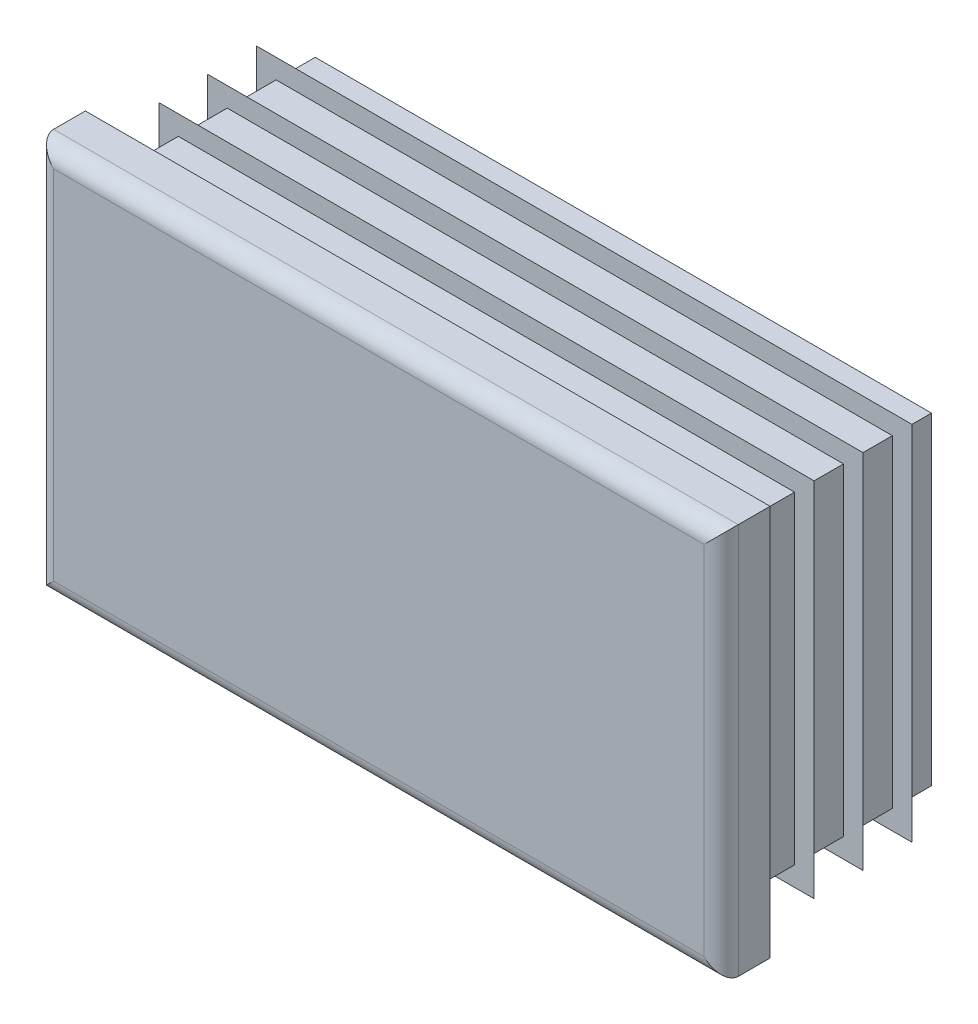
ISO-10303-21;
HEADER;
FILE_DESCRIPTION(('STEP AP214'),'2;1');
FILE_NAME('part.step','',(''),(''),'','','');
FILE_SCHEMA(('AUTOMOTIVE_DESIGN { 1 0 10303 214 1 1 1 1 }'));
ENDSEC;
DATA;
#1=APPLICATION_CONTEXT('core data for automotive mechanical design processes');
#2=APPLICATION_PROTOCOL_DEFINITION('international standard','automotive_design',2000,#1);
#3=PRODUCT_CONTEXT('',#1,'mechanical');
#4=PRODUCT('Part','Part','',(#3));
#5=PRODUCT_RELATED_PRODUCT_CATEGORY('part','',(#4));
#6=PRODUCT_DEFINITION_FORMATION('','',#4);
#7=PRODUCT_DEFINITION_CONTEXT('part definition',#1,'design');
#8=PRODUCT_DEFINITION('design','',#6,#7);
#9=PRODUCT_DEFINITION_SHAPE('','',#8);
#10=(LENGTH_UNIT() NAMED_UNIT(*) SI_UNIT(.MILLI.,.METRE.));
#11=(NAMED_UNIT(*) PLANE_ANGLE_UNIT() SI_UNIT($,.RADIAN.));
#12=(NAMED_UNIT(*) SI_UNIT($,.STERADIAN.) SOLID_ANGLE_UNIT());
#13=UNCERTAINTY_MEASURE_WITH_UNIT(LENGTH_MEASURE(1.E-05),#10,'distance_accuracy_value','');
#14=(GEOMETRIC_REPRESENTATION_CONTEXT(3) GLOBAL_UNCERTAINTY_ASSIGNED_CONTEXT((#13)) GLOBAL_UNIT_ASSIGNED_CONTEXT((#10,
#11,#12)) REPRESENTATION_CONTEXT('',''));
#15=CARTESIAN_POINT('',(0.,0.,0.));
#16=DIRECTION('',(0.,0.,1.));
#17=DIRECTION('',(1.,0.,0.));
#18=AXIS2_PLACEMENT_3D('',#15,#16,#17);
#19=CARTESIAN_POINT('',(33.25,-20.,5.));
#20=DIRECTION('',(0.,0.,-1.));
#21=DIRECTION('',(0.,1.,0.));
#22=AXIS2_PLACEMENT_3D('',#19,#20,#21);
#23=PLANE('',#22);
#24=DIRECTION('',(0.,1.,0.));
#25=VECTOR('',#24,1.);
#26=CARTESIAN_POINT('',(-33.25,-20.,5.));
#27=LINE('',#26,#25);
#28=CARTESIAN_POINT('',(-33.25,-18.25,5.));
#29=VERTEX_POINT('',#28);
#30=CARTESIAN_POINT('',(-33.25,18.25,5.));
#31=VERTEX_POINT('',#30);
#32=EDGE_CURVE('E310',#29,#31,#27,.T.);
#33=ORIENTED_EDGE('',*,*,#32,.F.);
#34=DIRECTION('',(-1.,0.,0.));
#35=VECTOR('',#34,1.);
#36=CARTESIAN_POINT('',(35.,-18.25,5.));
#37=LINE('',#36,#35);
#38=CARTESIAN_POINT('',(33.25,-18.25,5.));
#39=VERTEX_POINT('',#38);
#40=EDGE_CURVE('E482',#39,#29,#37,.T.);
#41=ORIENTED_EDGE('',*,*,#40,.F.);
#42=DIRECTION('',(0.,1.,0.));
#43=VECTOR('',#42,1.);
#44=CARTESIAN_POINT('',(33.25,-20.,5.));
#45=LINE('',#44,#43);
#46=CARTESIAN_POINT('',(33.25,18.25,5.));
#47=VERTEX_POINT('',#46);
#48=EDGE_CURVE('E305',#39,#47,#45,.T.);
#49=ORIENTED_EDGE('',*,*,#48,.T.);
#50=DIRECTION('',(-1.,0.,0.));
#51=VECTOR('',#50,1.);
#52=CARTESIAN_POINT('',(35.,18.25,5.));
#53=LINE('',#52,#51);
#54=EDGE_CURVE('E630',#47,#31,#53,.T.);
#55=ORIENTED_EDGE('',*,*,#54,.T.);
#56=EDGE_LOOP('',(#33,#41,#49,#55));
#57=FACE_BOUND('',#56,.T.);
#58=ADVANCED_FACE('F14',(#57),#23,.F.);
#59=CARTESIAN_POINT('',(-33.25,-20.,3.25));
#60=DIRECTION('',(0.,1.,0.));
#61=DIRECTION('',(-1.,0.,0.));
#62=AXIS2_PLACEMENT_3D('',#59,#60,#61);
#63=CYLINDRICAL_SURFACE('',#62,1.75);
#64=DIRECTION('',(0.,1.,0.));
#65=VECTOR('',#64,1.);
#66=CARTESIAN_POINT('',(-35.,-20.,3.25));
#67=LINE('',#66,#65);
#68=CARTESIAN_POINT('',(-35.,-20.,3.25));
#69=VERTEX_POINT('',#68);
#70=CARTESIAN_POINT('',(-35.,20.,3.25));
#71=VERTEX_POINT('',#70);
#72=EDGE_CURVE('E402',#69,#71,#67,.T.);
#73=ORIENTED_EDGE('',*,*,#72,.F.);
#74=CARTESIAN_POINT('',(-33.25,-18.25,3.25));
#75=DIRECTION('',(-0.707106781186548,0.707106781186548,0.));
#76=DIRECTION('',(0.707106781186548,0.707106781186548,0.));
#77=AXIS2_PLACEMENT_3D('',#74,#75,#76);
#78=ELLIPSE('',#77,2.47487373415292,1.75);
#79=EDGE_CURVE('E59',#69,#29,#78,.T.);
#80=ORIENTED_EDGE('',*,*,#79,.T.);
#81=ORIENTED_EDGE('',*,*,#32,.T.);
#82=CARTESIAN_POINT('',(-33.25,18.25,3.25));
#83=DIRECTION('',(0.707106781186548,0.707106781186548,0.));
#84=DIRECTION('',(-0.707106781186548,0.707106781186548,0.));
#85=AXIS2_PLACEMENT_3D('',#82,#83,#84);
#86=ELLIPSE('',#85,2.47487373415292,1.75);
#87=EDGE_CURVE('E306',#31,#71,#86,.F.);
#88=ORIENTED_EDGE('',*,*,#87,.T.);
#89=EDGE_LOOP('',(#73,#80,#81,#88));
#90=FACE_BOUND('',#89,.T.);
#91=ADVANCED_FACE('F16',(#90),#63,.T.);
#92=CARTESIAN_POINT('',(-35.,-20.,3.25));
#93=DIRECTION('',(1.,0.,0.));
#94=DIRECTION('',(0.,1.,0.));
#95=AXIS2_PLACEMENT_3D('',#92,#93,#94);
#96=PLANE('',#95);
#97=DIRECTION('',(0.,0.,-1.));
#98=VECTOR('',#97,1.);
#99=CARTESIAN_POINT('',(-35.,20.,3.25));
#100=LINE('',#99,#98);
#101=CARTESIAN_POINT('',(-35.,20.,0.));
#102=VERTEX_POINT('',#101);
#103=EDGE_CURVE('E615',#71,#102,#100,.T.);
#104=ORIENTED_EDGE('',*,*,#103,.T.);
#105=DIRECTION('',(0.,1.,0.));
#106=VECTOR('',#105,1.);
#107=CARTESIAN_POINT('',(-35.,-20.,0.));
#108=LINE('',#107,#106);
#109=CARTESIAN_POINT('',(-35.,-20.,0.));
#110=VERTEX_POINT('',#109);
#111=EDGE_CURVE('E400',#110,#102,#108,.T.);
#112=ORIENTED_EDGE('',*,*,#111,.F.);
#113=DIRECTION('',(0.,0.,-1.));
#114=VECTOR('',#113,1.);
#115=CARTESIAN_POINT('',(-35.,-20.,3.25));
#116=LINE('',#115,#114);
#117=EDGE_CURVE('E616',#69,#110,#116,.T.);
#118=ORIENTED_EDGE('',*,*,#117,.F.);
#119=ORIENTED_EDGE('',*,*,#72,.T.);
#120=EDGE_LOOP('',(#104,#112,#118,#119));
#121=FACE_BOUND('',#120,.T.);
#122=ADVANCED_FACE('F697',(#121),#96,.F.);
#123=CARTESIAN_POINT('',(-31.5,-20.,0.));
#124=DIRECTION('',(1.,0.,0.));
#125=DIRECTION('',(0.,1.,0.));
#126=AXIS2_PLACEMENT_3D('',#123,#124,#125);
#127=PLANE('',#126);
#128=DIRECTION('',(0.,1.,0.));
#129=VECTOR('',#128,1.);
#130=CARTESIAN_POINT('',(-31.5,-20.,0.));
#131=LINE('',#130,#129);
#132=CARTESIAN_POINT('',(-31.5,-16.5,0.));
#133=VERTEX_POINT('',#132);
#134=CARTESIAN_POINT('',(-31.5,16.5,0.));
#135=VERTEX_POINT('',#134);
#136=EDGE_CURVE('E397',#133,#135,#131,.T.);
#137=ORIENTED_EDGE('',*,*,#136,.T.);
#138=DIRECTION('',(0.,0.,-1.));
#139=VECTOR('',#138,1.);
#140=CARTESIAN_POINT('',(-31.5,16.5,0.));
#141=LINE('',#140,#139);
#142=CARTESIAN_POINT('',(-31.5,16.5,-1.));
#143=VERTEX_POINT('',#142);
#144=EDGE_CURVE('E495',#135,#143,#141,.T.);
#145=ORIENTED_EDGE('',*,*,#144,.T.);
#146=DIRECTION('',(0.,1.,0.));
#147=VECTOR('',#146,1.);
#148=CARTESIAN_POINT('',(-31.5,-20.,-1.));
#149=LINE('',#148,#147);
#150=CARTESIAN_POINT('',(-31.5,-16.5,-1.));
#151=VERTEX_POINT('',#150);
#152=EDGE_CURVE('E394',#151,#143,#149,.T.);
#153=ORIENTED_EDGE('',*,*,#152,.F.);
#154=DIRECTION('',(0.,0.,1.));
#155=VECTOR('',#154,1.);
#156=CARTESIAN_POINT('',(-31.5,-16.5,0.));
#157=LINE('',#156,#155);
#158=EDGE_CURVE('E489',#151,#133,#157,.T.);
#159=ORIENTED_EDGE('',*,*,#158,.T.);
#160=EDGE_LOOP('',(#137,#145,#153,#159));
#161=FACE_BOUND('',#160,.T.);
#162=ADVANCED_FACE('F787',(#161),#127,.F.);
#163=CARTESIAN_POINT('',(-33.5,-20.,-1.));
#164=DIRECTION('',(0.342020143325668,0.,0.939692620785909));
#165=DIRECTION('',(-0.939692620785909,0.,0.342020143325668));
#166=AXIS2_PLACEMENT_3D('',#163,#164,#165);
#167=PLANE('',#166);
#168=DIRECTION('',(0.,1.,0.));
#169=VECTOR('',#168,1.);
#170=CARTESIAN_POINT('',(-33.5,-20.,-1.));
#171=LINE('',#170,#169);
#172=CARTESIAN_POINT('',(-33.5,-18.5,-1.));
#173=VERTEX_POINT('',#172);
#174=CARTESIAN_POINT('',(-33.5,18.5,-1.));
#175=VERTEX_POINT('',#174);
#176=EDGE_CURVE('E392',#173,#175,#171,.T.);
#177=ORIENTED_EDGE('',*,*,#176,.T.);
#178=DIRECTION('',(0.844349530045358,-0.43889572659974,-0.307318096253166));
#179=VECTOR('',#178,1.);
#180=CARTESIAN_POINT('',(-19.2326160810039,11.0837658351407,-6.19290306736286));
#181=LINE('',#180,#179);
#182=CARTESIAN_POINT('',(-31.5,17.4603932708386,-1.7279404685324));
#183=VERTEX_POINT('',#182);
#184=EDGE_CURVE('E519',#175,#183,#181,.T.);
#185=ORIENTED_EDGE('',*,*,#184,.T.);
#186=DIRECTION('',(0.,1.,0.));
#187=VECTOR('',#186,1.);
#188=CARTESIAN_POINT('',(-31.5,-20.,-1.7279404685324));
#189=LINE('',#188,#187);
#190=CARTESIAN_POINT('',(-31.5,-17.4603932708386,-1.7279404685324));
#191=VERTEX_POINT('',#190);
#192=EDGE_CURVE('E389',#191,#183,#189,.T.);
#193=ORIENTED_EDGE('',*,*,#192,.F.);
#194=DIRECTION('',(-0.844349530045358,-0.43889572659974,0.307318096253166));
#195=VECTOR('',#194,1.);
#196=CARTESIAN_POINT('',(-34.0558721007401,-18.7889441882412,-0.797679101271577));
#197=LINE('',#196,#195);
#198=EDGE_CURVE('E507',#191,#173,#197,.T.);
#199=ORIENTED_EDGE('',*,*,#198,.T.);
#200=EDGE_LOOP('',(#177,#185,#193,#199));
#201=FACE_BOUND('',#200,.T.);
#202=ADVANCED_FACE('F783',(#201),#167,.F.);
#203=CARTESIAN_POINT('',(-31.5,-20.,-1.7279404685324));
#204=DIRECTION('',(1.,0.,0.));
#205=DIRECTION('',(0.,1.,0.));
#206=AXIS2_PLACEMENT_3D('',#203,#204,#205);
#207=PLANE('',#206);
#208=ORIENTED_EDGE('',*,*,#192,.T.);
#209=DIRECTION('',(0.,-0.819152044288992,-0.573576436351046));
#210=VECTOR('',#209,1.);
#211=CARTESIAN_POINT('',(-31.5,-7.67590790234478,-19.328568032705));
#212=LINE('',#211,#210);
#213=CARTESIAN_POINT('',(-31.5,16.5,-2.40041507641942));
#214=VERTEX_POINT('',#213);
#215=EDGE_CURVE('E516',#183,#214,#212,.T.);
#216=ORIENTED_EDGE('',*,*,#215,.T.);
#217=DIRECTION('',(0.,0.,-1.));
#218=VECTOR('',#217,1.);
#219=CARTESIAN_POINT('',(-31.5,16.5,-1.7279404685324));
#220=LINE('',#219,#218);
#221=CARTESIAN_POINT('',(-31.5,16.5,-6.));
#222=VERTEX_POINT('',#221);
#223=EDGE_CURVE('E525',#214,#222,#220,.T.);
#224=ORIENTED_EDGE('',*,*,#223,.T.);
#225=DIRECTION('',(0.,1.,0.));
#226=VECTOR('',#225,1.);
#227=CARTESIAN_POINT('',(-31.5,-20.,-6.));
#228=LINE('',#227,#226);
#229=CARTESIAN_POINT('',(-31.5,-16.5,-6.));
#230=VERTEX_POINT('',#229);
#231=EDGE_CURVE('E386',#230,#222,#228,.T.);
#232=ORIENTED_EDGE('',*,*,#231,.F.);
#233=DIRECTION('',(0.,0.,1.));
#234=VECTOR('',#233,1.);
#235=CARTESIAN_POINT('',(-31.5,-16.5,-1.7279404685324));
#236=LINE('',#235,#234);
#237=CARTESIAN_POINT('',(-31.5,-16.5,-2.40041507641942));
#238=VERTEX_POINT('',#237);
#239=EDGE_CURVE('E522',#230,#238,#236,.T.);
#240=ORIENTED_EDGE('',*,*,#239,.T.);
#241=DIRECTION('',(0.,-0.819152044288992,0.573576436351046));
#242=VECTOR('',#241,1.);
#243=CARTESIAN_POINT('',(-31.5,-19.1644949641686,-0.534715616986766));
#244=LINE('',#243,#242);
#245=EDGE_CURVE('E504',#238,#191,#244,.T.);
#246=ORIENTED_EDGE('',*,*,#245,.T.);
#247=EDGE_LOOP('',(#208,#216,#224,#232,#240,#246));
#248=FACE_BOUND('',#247,.T.);
#249=ADVANCED_FACE('F779',(#248),#207,.F.);
#250=CARTESIAN_POINT('',(-33.5,-20.,-6.));
#251=DIRECTION('',(0.342020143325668,0.,0.939692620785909));
#252=DIRECTION('',(-0.939692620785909,0.,0.342020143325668));
#253=AXIS2_PLACEMENT_3D('',#250,#251,#252);
#254=PLANE('',#253);
#255=DIRECTION('',(0.,1.,0.));
#256=VECTOR('',#255,1.);
#257=CARTESIAN_POINT('',(-33.5,-20.,-6.));
#258=LINE('',#257,#256);
#259=CARTESIAN_POINT('',(-33.5,-18.5,-6.));
#260=VERTEX_POINT('',#259);
#261=CARTESIAN_POINT('',(-33.5,18.5,-6.));
#262=VERTEX_POINT('',#261);
#263=EDGE_CURVE('E384',#260,#262,#258,.T.);
#264=ORIENTED_EDGE('',*,*,#263,.T.);
#265=DIRECTION('',(0.844349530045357,-0.43889572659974,-0.307318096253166));
#266=VECTOR('',#265,1.);
#267=CARTESIAN_POINT('',(-19.2326160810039,11.0837658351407,-11.1929030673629));
#268=LINE('',#267,#266);
#269=CARTESIAN_POINT('',(-31.5,17.4603932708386,-6.72794046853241));
#270=VERTEX_POINT('',#269);
#271=EDGE_CURVE('E549',#262,#270,#268,.T.);
#272=ORIENTED_EDGE('',*,*,#271,.T.);
#273=DIRECTION('',(0.,1.,0.));
#274=VECTOR('',#273,1.);
#275=CARTESIAN_POINT('',(-31.5,-20.,-6.72794046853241));
#276=LINE('',#275,#274);
#277=CARTESIAN_POINT('',(-31.5,-17.4603932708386,-6.72794046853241));
#278=VERTEX_POINT('',#277);
#279=EDGE_CURVE('E381',#278,#270,#276,.T.);
#280=ORIENTED_EDGE('',*,*,#279,.F.);
#281=DIRECTION('',(-0.844349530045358,-0.438895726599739,0.307318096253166));
#282=VECTOR('',#281,1.);
#283=CARTESIAN_POINT('',(-34.0558721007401,-18.7889441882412,-5.79767910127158));
#284=LINE('',#283,#282);
#285=EDGE_CURVE('E537',#278,#260,#284,.T.);
#286=ORIENTED_EDGE('',*,*,#285,.T.);
#287=EDGE_LOOP('',(#264,#272,#280,#286));
#288=FACE_BOUND('',#287,.T.);
#289=ADVANCED_FACE('F775',(#288),#254,.F.);
#290=CARTESIAN_POINT('',(-31.5,-20.,-6.72794046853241));
#291=DIRECTION('',(1.,0.,0.));
#292=DIRECTION('',(0.,1.,0.));
#293=AXIS2_PLACEMENT_3D('',#290,#291,#292);
#294=PLANE('',#293);
#295=ORIENTED_EDGE('',*,*,#279,.T.);
#296=DIRECTION('',(0.,-0.819152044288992,-0.573576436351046));
#297=VECTOR('',#296,1.);
#298=CARTESIAN_POINT('',(-31.5,-7.67590790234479,-24.3285680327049));
#299=LINE('',#298,#297);
#300=CARTESIAN_POINT('',(-31.5,16.5,-7.40041507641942));
#301=VERTEX_POINT('',#300);
#302=EDGE_CURVE('E546',#270,#301,#299,.T.);
#303=ORIENTED_EDGE('',*,*,#302,.T.);
#304=DIRECTION('',(0.,0.,-1.));
#305=VECTOR('',#304,1.);
#306=CARTESIAN_POINT('',(-31.5,16.5,-6.72794046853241));
#307=LINE('',#306,#305);
#308=CARTESIAN_POINT('',(-31.5,16.5,-11.));
#309=VERTEX_POINT('',#308);
#310=EDGE_CURVE('E555',#301,#309,#307,.T.);
#311=ORIENTED_EDGE('',*,*,#310,.T.);
#312=DIRECTION('',(0.,1.,0.));
#313=VECTOR('',#312,1.);
#314=CARTESIAN_POINT('',(-31.5,-20.,-11.));
#315=LINE('',#314,#313);
#316=CARTESIAN_POINT('',(-31.5,-16.5,-11.));
#317=VERTEX_POINT('',#316);
#318=EDGE_CURVE('E378',#317,#309,#315,.T.);
#319=ORIENTED_EDGE('',*,*,#318,.F.);
#320=DIRECTION('',(0.,0.,1.));
#321=VECTOR('',#320,1.);
#322=CARTESIAN_POINT('',(-31.5,-16.5,-6.72794046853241));
#323=LINE('',#322,#321);
#324=CARTESIAN_POINT('',(-31.5,-16.5,-7.40041507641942));
#325=VERTEX_POINT('',#324);
#326=EDGE_CURVE('E552',#317,#325,#323,.T.);
#327=ORIENTED_EDGE('',*,*,#326,.T.);
#328=DIRECTION('',(0.,-0.819152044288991,0.573576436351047));
#329=VECTOR('',#328,1.);
#330=CARTESIAN_POINT('',(-31.5,-19.1644949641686,-5.53471561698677));
#331=LINE('',#330,#329);
#332=EDGE_CURVE('E534',#325,#278,#331,.T.);
#333=ORIENTED_EDGE('',*,*,#332,.T.);
#334=EDGE_LOOP('',(#295,#303,#311,#319,#327,#333));
#335=FACE_BOUND('',#334,.T.);
#336=ADVANCED_FACE('F771',(#335),#294,.F.);
#337=CARTESIAN_POINT('',(-33.5,-20.,-11.));
#338=DIRECTION('',(0.342020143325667,0.,0.939692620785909));
#339=DIRECTION('',(-0.939692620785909,0.,0.342020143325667));
#340=AXIS2_PLACEMENT_3D('',#337,#338,#339);
#341=PLANE('',#340);
#342=DIRECTION('',(0.,1.,0.));
#343=VECTOR('',#342,1.);
#344=CARTESIAN_POINT('',(-33.5,-20.,-11.));
#345=LINE('',#344,#343);
#346=CARTESIAN_POINT('',(-33.5,-18.5,-11.));
#347=VERTEX_POINT('',#346);
#348=CARTESIAN_POINT('',(-33.5,18.5,-11.));
#349=VERTEX_POINT('',#348);
#350=EDGE_CURVE('E376',#347,#349,#345,.T.);
#351=ORIENTED_EDGE('',*,*,#350,.T.);
#352=DIRECTION('',(0.844349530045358,-0.438895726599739,-0.307318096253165));
#353=VECTOR('',#352,1.);
#354=CARTESIAN_POINT('',(-19.2326160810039,11.0837658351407,-16.1929030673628));
#355=LINE('',#354,#353);
#356=CARTESIAN_POINT('',(-31.5,17.4603932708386,-11.7279404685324));
#357=VERTEX_POINT('',#356);
#358=EDGE_CURVE('E579',#349,#357,#355,.T.);
#359=ORIENTED_EDGE('',*,*,#358,.T.);
#360=DIRECTION('',(0.,1.,0.));
#361=VECTOR('',#360,1.);
#362=CARTESIAN_POINT('',(-31.5,-20.,-11.7279404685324));
#363=LINE('',#362,#361);
#364=CARTESIAN_POINT('',(-31.5,-17.4603932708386,-11.7279404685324));
#365=VERTEX_POINT('',#364);
#366=EDGE_CURVE('E373',#365,#357,#363,.T.);
#367=ORIENTED_EDGE('',*,*,#366,.F.);
#368=DIRECTION('',(-0.844349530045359,-0.438895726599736,0.307318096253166));
#369=VECTOR('',#368,1.);
#370=CARTESIAN_POINT('',(-34.0558721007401,-18.7889441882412,-10.7976791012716));
#371=LINE('',#370,#369);
#372=EDGE_CURVE('E567',#365,#347,#371,.T.);
#373=ORIENTED_EDGE('',*,*,#372,.T.);
#374=EDGE_LOOP('',(#351,#359,#367,#373));
#375=FACE_BOUND('',#374,.T.);
#376=ADVANCED_FACE('F767',(#375),#341,.F.);
#377=CARTESIAN_POINT('',(-31.5,-20.,-11.7279404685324));
#378=DIRECTION('',(1.,0.,0.));
#379=DIRECTION('',(0.,1.,0.));
#380=AXIS2_PLACEMENT_3D('',#377,#378,#379);
#381=PLANE('',#380);
#382=ORIENTED_EDGE('',*,*,#366,.T.);
#383=DIRECTION('',(0.,-0.819152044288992,-0.573576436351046));
#384=VECTOR('',#383,1.);
#385=CARTESIAN_POINT('',(-31.5,-7.67590790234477,-29.328568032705));
#386=LINE('',#385,#384);
#387=CARTESIAN_POINT('',(-31.5,16.5,-12.4004150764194));
#388=VERTEX_POINT('',#387);
#389=EDGE_CURVE('E576',#357,#388,#386,.T.);
#390=ORIENTED_EDGE('',*,*,#389,.T.);
#391=DIRECTION('',(0.,0.,-1.));
#392=VECTOR('',#391,1.);
#393=CARTESIAN_POINT('',(-31.5,16.5,-11.7279404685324));
#394=LINE('',#393,#392);
#395=CARTESIAN_POINT('',(-31.5,16.5,-16.));
#396=VERTEX_POINT('',#395);
#397=EDGE_CURVE('E585',#388,#396,#394,.T.);
#398=ORIENTED_EDGE('',*,*,#397,.T.);
#399=DIRECTION('',(0.,1.,0.));
#400=VECTOR('',#399,1.);
#401=CARTESIAN_POINT('',(-31.5,-20.,-16.));
#402=LINE('',#401,#400);
#403=CARTESIAN_POINT('',(-31.5,-16.5,-16.));
#404=VERTEX_POINT('',#403);
#405=EDGE_CURVE('E370',#404,#396,#402,.T.);
#406=ORIENTED_EDGE('',*,*,#405,.F.);
#407=DIRECTION('',(0.,0.,1.));
#408=VECTOR('',#407,1.);
#409=CARTESIAN_POINT('',(-31.5,-16.5,-11.7279404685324));
#410=LINE('',#409,#408);
#411=CARTESIAN_POINT('',(-31.5,-16.5,-12.4004150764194));
#412=VERTEX_POINT('',#411);
#413=EDGE_CURVE('E582',#404,#412,#410,.T.);
#414=ORIENTED_EDGE('',*,*,#413,.T.);
#415=DIRECTION('',(0.,-0.81915204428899,0.573576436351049));
#416=VECTOR('',#415,1.);
#417=CARTESIAN_POINT('',(-31.5,-19.1644949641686,-10.5347156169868));
#418=LINE('',#417,#416);
#419=EDGE_CURVE('E564',#412,#365,#418,.T.);
#420=ORIENTED_EDGE('',*,*,#419,.T.);
#421=EDGE_LOOP('',(#382,#390,#398,#406,#414,#420));
#422=FACE_BOUND('',#421,.T.);
#423=ADVANCED_FACE('F764',(#422),#381,.F.);
#424=CARTESIAN_POINT('',(-33.5,-20.,-16.));
#425=DIRECTION('',(0.342020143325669,0.,0.939692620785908));
#426=DIRECTION('',(-0.939692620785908,0.,0.342020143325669));
#427=AXIS2_PLACEMENT_3D('',#424,#425,#426);
#428=PLANE('',#427);
#429=DIRECTION('',(0.,1.,0.));
#430=VECTOR('',#429,1.);
#431=CARTESIAN_POINT('',(-33.5,-20.,-16.));
#432=LINE('',#431,#430);
#433=CARTESIAN_POINT('',(-33.5,-18.5,-16.));
#434=VERTEX_POINT('',#433);
#435=CARTESIAN_POINT('',(-33.5,18.5,-16.));
#436=VERTEX_POINT('',#435);
#437=EDGE_CURVE('E368',#434,#436,#432,.T.);
#438=ORIENTED_EDGE('',*,*,#437,.T.);
#439=DIRECTION('',(0.844349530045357,-0.438895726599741,-0.307318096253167));
#440=VECTOR('',#439,1.);
#441=CARTESIAN_POINT('',(-19.2326160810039,11.0837658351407,-21.1929030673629));
#442=LINE('',#441,#440);
#443=CARTESIAN_POINT('',(-31.5,17.4603932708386,-16.7279404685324));
#444=VERTEX_POINT('',#443);
#445=EDGE_CURVE('E607',#436,#444,#442,.T.);
#446=ORIENTED_EDGE('',*,*,#445,.T.);
#447=DIRECTION('',(0.,1.,0.));
#448=VECTOR('',#447,1.);
#449=CARTESIAN_POINT('',(-31.5,-20.,-16.7279404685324));
#450=LINE('',#449,#448);
#451=CARTESIAN_POINT('',(-31.5,-17.4603932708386,-16.7279404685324));
#452=VERTEX_POINT('',#451);
#453=EDGE_CURVE('E365',#452,#444,#450,.T.);
#454=ORIENTED_EDGE('',*,*,#453,.F.);
#455=DIRECTION('',(-0.844349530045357,-0.438895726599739,0.307318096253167));
#456=VECTOR('',#455,1.);
#457=CARTESIAN_POINT('',(-34.0558721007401,-18.7889441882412,-15.7976791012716));
#458=LINE('',#457,#456);
#459=EDGE_CURVE('E595',#452,#434,#458,.T.);
#460=ORIENTED_EDGE('',*,*,#459,.T.);
#461=EDGE_LOOP('',(#438,#446,#454,#460));
#462=FACE_BOUND('',#461,.T.);
#463=ADVANCED_FACE('F675',(#462),#428,.F.);
#464=CARTESIAN_POINT('',(-31.5,-20.,-16.7279404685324));
#465=DIRECTION('',(1.,0.,0.));
#466=DIRECTION('',(0.,1.,0.));
#467=AXIS2_PLACEMENT_3D('',#464,#465,#466);
#468=PLANE('',#467);
#469=ORIENTED_EDGE('',*,*,#453,.T.);
#470=DIRECTION('',(0.,-0.819152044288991,-0.573576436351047));
#471=VECTOR('',#470,1.);
#472=CARTESIAN_POINT('',(-31.5,-7.67590790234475,-34.3285680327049));
#473=LINE('',#472,#471);
#474=CARTESIAN_POINT('',(-31.5,16.5,-17.4004150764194));
#475=VERTEX_POINT('',#474);
#476=EDGE_CURVE('E604',#444,#475,#473,.T.);
#477=ORIENTED_EDGE('',*,*,#476,.T.);
#478=DIRECTION('',(0.,0.,-1.));
#479=VECTOR('',#478,1.);
#480=CARTESIAN_POINT('',(-31.5,16.5,-16.7279404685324));
#481=LINE('',#480,#479);
#482=CARTESIAN_POINT('',(-31.5,16.5,-20.));
#483=VERTEX_POINT('',#482);
#484=EDGE_CURVE('E613',#475,#483,#481,.T.);
#485=ORIENTED_EDGE('',*,*,#484,.T.);
#486=DIRECTION('',(0.,1.,0.));
#487=VECTOR('',#486,1.);
#488=CARTESIAN_POINT('',(-31.5,-20.,-20.));
#489=LINE('',#488,#487);
#490=CARTESIAN_POINT('',(-31.5,-16.5,-20.));
#491=VERTEX_POINT('',#490);
#492=EDGE_CURVE('E362',#491,#483,#489,.T.);
#493=ORIENTED_EDGE('',*,*,#492,.F.);
#494=DIRECTION('',(0.,0.,1.));
#495=VECTOR('',#494,1.);
#496=CARTESIAN_POINT('',(-31.5,-16.5,-16.7279404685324));
#497=LINE('',#496,#495);
#498=CARTESIAN_POINT('',(-31.5,-16.5,-17.4004150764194));
#499=VERTEX_POINT('',#498);
#500=EDGE_CURVE('E610',#491,#499,#497,.T.);
#501=ORIENTED_EDGE('',*,*,#500,.T.);
#502=DIRECTION('',(0.,-0.81915204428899,0.573576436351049));
#503=VECTOR('',#502,1.);
#504=CARTESIAN_POINT('',(-31.5,-19.1644949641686,-15.5347156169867));
#505=LINE('',#504,#503);
#506=EDGE_CURVE('E592',#499,#452,#505,.T.);
#507=ORIENTED_EDGE('',*,*,#506,.T.);
#508=EDGE_LOOP('',(#469,#477,#485,#493,#501,#507));
#509=FACE_BOUND('',#508,.T.);
#510=ADVANCED_FACE('F677',(#509),#468,.F.);
#511=CARTESIAN_POINT('',(-31.5,-20.,-20.));
#512=DIRECTION('',(0.,0.,1.));
#513=DIRECTION('',(0.,-1.,0.));
#514=AXIS2_PLACEMENT_3D('',#511,#512,#513);
#515=PLANE('',#514);
#516=ORIENTED_EDGE('',*,*,#492,.T.);
#517=DIRECTION('',(-1.,0.,0.));
#518=VECTOR('',#517,1.);
#519=CARTESIAN_POINT('',(35.,16.5,-20.));
#520=LINE('',#519,#518);
#521=CARTESIAN_POINT('',(31.5,16.5,-20.));
#522=VERTEX_POINT('',#521);
#523=EDGE_CURVE('E438',#522,#483,#520,.T.);
#524=ORIENTED_EDGE('',*,*,#523,.F.);
#525=DIRECTION('',(0.,1.,0.));
#526=VECTOR('',#525,1.);
#527=CARTESIAN_POINT('',(31.5,-20.,-20.));
#528=LINE('',#527,#526);
#529=CARTESIAN_POINT('',(31.5,-16.5,-20.));
#530=VERTEX_POINT('',#529);
#531=EDGE_CURVE('E359',#530,#522,#528,.T.);
#532=ORIENTED_EDGE('',*,*,#531,.F.);
#533=DIRECTION('',(-1.,0.,0.));
#534=VECTOR('',#533,1.);
#535=CARTESIAN_POINT('',(35.,-16.5,-20.));
#536=LINE('',#535,#534);
#537=EDGE_CURVE('E436',#530,#491,#536,.T.);
#538=ORIENTED_EDGE('',*,*,#537,.T.);
#539=EDGE_LOOP('',(#516,#524,#532,#538));
#540=FACE_BOUND('',#539,.T.);
#541=ADVANCED_FACE('F435',(#540),#515,.F.);
#542=CARTESIAN_POINT('',(31.5,-20.,-20.));
#543=DIRECTION('',(-1.,0.,0.));
#544=DIRECTION('',(0.,-1.,0.));
#545=AXIS2_PLACEMENT_3D('',#542,#543,#544);
#546=PLANE('',#545);
#547=DIRECTION('',(0.,0.,1.));
#548=VECTOR('',#547,1.);
#549=CARTESIAN_POINT('',(31.5,16.5,-20.));
#550=LINE('',#549,#548);
#551=CARTESIAN_POINT('',(31.5,16.5,-17.4004150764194));
#552=VERTEX_POINT('',#551);
#553=EDGE_CURVE('E9',#522,#552,#550,.T.);
#554=ORIENTED_EDGE('',*,*,#553,.T.);
#555=DIRECTION('',(0.,0.819152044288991,0.573576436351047));
#556=VECTOR('',#555,1.);
#557=CARTESIAN_POINT('',(31.5,-9.2132730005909,-35.4050426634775));
#558=LINE('',#557,#556);
#559=CARTESIAN_POINT('',(31.5,17.4603932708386,-16.7279404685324));
#560=VERTEX_POINT('',#559);
#561=EDGE_CURVE('E601',#552,#560,#558,.T.);
#562=ORIENTED_EDGE('',*,*,#561,.T.);
#563=DIRECTION('',(0.,1.,0.));
#564=VECTOR('',#563,1.);
#565=CARTESIAN_POINT('',(31.5,-20.,-16.7279404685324));
#566=LINE('',#565,#564);
#567=CARTESIAN_POINT('',(31.5,-17.4603932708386,-16.7279404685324));
#568=VERTEX_POINT('',#567);
#569=EDGE_CURVE('E356',#568,#560,#566,.T.);
#570=ORIENTED_EDGE('',*,*,#569,.F.);
#571=DIRECTION('',(0.,0.81915204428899,-0.573576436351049));
#572=VECTOR('',#571,1.);
#573=CARTESIAN_POINT('',(31.5,-17.6271298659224,-16.6111902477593));
#574=LINE('',#573,#572);
#575=CARTESIAN_POINT('',(31.5,-16.5,-17.4004150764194));
#576=VERTEX_POINT('',#575);
#577=EDGE_CURVE('E428',#568,#576,#574,.T.);
#578=ORIENTED_EDGE('',*,*,#577,.T.);
#579=DIRECTION('',(0.,0.,-1.));
#580=VECTOR('',#579,1.);
#581=CARTESIAN_POINT('',(31.5,-16.5,-20.));
#582=LINE('',#581,#580);
#583=EDGE_CURVE('E23',#576,#530,#582,.T.);
#584=ORIENTED_EDGE('',*,*,#583,.T.);
#585=ORIENTED_EDGE('',*,*,#531,.T.);
#586=EDGE_LOOP('',(#554,#562,#570,#578,#584,#585));
#587=FACE_BOUND('',#586,.T.);
#588=ADVANCED_FACE('F426',(#587),#546,.F.);
#589=CARTESIAN_POINT('',(31.5,-20.,-16.7279404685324));
#590=DIRECTION('',(-0.342020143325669,0.,0.939692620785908));
#591=DIRECTION('',(-0.939692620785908,0.,-0.342020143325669));
#592=AXIS2_PLACEMENT_3D('',#589,#590,#591);
#593=PLANE('',#592);
#594=ORIENTED_EDGE('',*,*,#569,.T.);
#595=DIRECTION('',(0.844349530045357,0.438895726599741,0.307318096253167));
#596=VECTOR('',#595,1.);
#597=CARTESIAN_POINT('',(17.6178749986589,10.244417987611,-21.7806207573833));
#598=LINE('',#597,#596);
#599=CARTESIAN_POINT('',(33.5,18.5,-16.));
#600=VERTEX_POINT('',#599);
#601=EDGE_CURVE('E598',#560,#600,#598,.T.);
#602=ORIENTED_EDGE('',*,*,#601,.T.);
#603=DIRECTION('',(0.,1.,0.));
#604=VECTOR('',#603,1.);
#605=CARTESIAN_POINT('',(33.5,-20.,-16.));
#606=LINE('',#605,#604);
#607=CARTESIAN_POINT('',(33.5,-18.5,-16.));
#608=VERTEX_POINT('',#607);
#609=EDGE_CURVE('E353',#608,#600,#606,.T.);
#610=ORIENTED_EDGE('',*,*,#609,.F.);
#611=DIRECTION('',(-0.844349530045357,0.438895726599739,-0.307318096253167));
#612=VECTOR('',#611,1.);
#613=CARTESIAN_POINT('',(32.4411310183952,-17.9495963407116,-16.3853967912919));
#614=LINE('',#613,#612);
#615=EDGE_CURVE('E588',#608,#568,#614,.T.);
#616=ORIENTED_EDGE('',*,*,#615,.T.);
#617=EDGE_LOOP('',(#594,#602,#610,#616));
#618=FACE_BOUND('',#617,.T.);
#619=ADVANCED_FACE('F752',(#618),#593,.F.);
#620=CARTESIAN_POINT('',(33.5,-20.,-16.));
#621=DIRECTION('',(0.,0.,-1.));
#622=DIRECTION('',(0.,1.,0.));
#623=AXIS2_PLACEMENT_3D('',#620,#621,#622);
#624=PLANE('',#623);
#625=ORIENTED_EDGE('',*,*,#609,.T.);
#626=DIRECTION('',(-1.,0.,0.));
#627=VECTOR('',#626,1.);
#628=CARTESIAN_POINT('',(35.,18.5,-16.));
#629=LINE('',#628,#627);
#630=EDGE_CURVE('E444',#600,#436,#629,.T.);
#631=ORIENTED_EDGE('',*,*,#630,.T.);
#632=ORIENTED_EDGE('',*,*,#437,.F.);
#633=DIRECTION('',(-1.,0.,0.));
#634=VECTOR('',#633,1.);
#635=CARTESIAN_POINT('',(35.,-18.5,-16.));
#636=LINE('',#635,#634);
#637=EDGE_CURVE('E451',#608,#434,#636,.T.);
#638=ORIENTED_EDGE('',*,*,#637,.F.);
#639=EDGE_LOOP('',(#625,#631,#632,#638));
#640=FACE_BOUND('',#639,.T.);
#641=ORIENTED_EDGE('',*,*,#405,.T.);
#642=DIRECTION('',(-1.,0.,0.));
#643=VECTOR('',#642,1.);
#644=CARTESIAN_POINT('',(35.,16.5,-16.));
#645=LINE('',#644,#643);
#646=CARTESIAN_POINT('',(31.5,16.5,-16.));
#647=VERTEX_POINT('',#646);
#648=EDGE_CURVE('E663',#647,#396,#645,.T.);
#649=ORIENTED_EDGE('',*,*,#648,.F.);
#650=DIRECTION('',(0.,1.,0.));
#651=VECTOR('',#650,1.);
#652=CARTESIAN_POINT('',(31.5,-20.,-16.));
#653=LINE('',#652,#651);
#654=CARTESIAN_POINT('',(31.5,-16.5,-16.));
#655=VERTEX_POINT('',#654);
#656=EDGE_CURVE('E350',#655,#647,#653,.T.);
#657=ORIENTED_EDGE('',*,*,#656,.F.);
#658=DIRECTION('',(-1.,0.,0.));
#659=VECTOR('',#658,1.);
#660=CARTESIAN_POINT('',(35.,-16.5,-16.));
#661=LINE('',#660,#659);
#662=EDGE_CURVE('E453',#655,#404,#661,.T.);
#663=ORIENTED_EDGE('',*,*,#662,.T.);
#664=EDGE_LOOP('',(#641,#649,#657,#663));
#665=FACE_BOUND('',#664,.T.);
#666=ADVANCED_FACE('F667',(#640,#665),#624,.F.);
#667=CARTESIAN_POINT('',(31.5,-20.,-16.));
#668=DIRECTION('',(-1.,0.,0.));
#669=DIRECTION('',(0.,-1.,0.));
#670=AXIS2_PLACEMENT_3D('',#667,#668,#669);
#671=PLANE('',#670);
#672=DIRECTION('',(0.,0.,1.));
#673=VECTOR('',#672,1.);
#674=CARTESIAN_POINT('',(31.5,16.5,-16.));
#675=LINE('',#674,#673);
#676=CARTESIAN_POINT('',(31.5,16.5,-12.4004150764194));
#677=VERTEX_POINT('',#676);
#678=EDGE_CURVE('E420',#647,#677,#675,.T.);
#679=ORIENTED_EDGE('',*,*,#678,.T.);
#680=DIRECTION('',(0.,0.819152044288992,0.573576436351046));
#681=VECTOR('',#680,1.);
#682=CARTESIAN_POINT('',(31.5,-9.68311931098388,-30.7340325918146));
#683=LINE('',#682,#681);
#684=CARTESIAN_POINT('',(31.5,17.4603932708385,-11.7279404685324));
#685=VERTEX_POINT('',#684);
#686=EDGE_CURVE('E573',#677,#685,#683,.T.);
#687=ORIENTED_EDGE('',*,*,#686,.T.);
#688=DIRECTION('',(0.,1.,0.));
#689=VECTOR('',#688,1.);
#690=CARTESIAN_POINT('',(31.5,-20.,-11.7279404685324));
#691=LINE('',#690,#689);
#692=CARTESIAN_POINT('',(31.5,-17.4603932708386,-11.7279404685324));
#693=VERTEX_POINT('',#692);
#694=EDGE_CURVE('E347',#693,#685,#691,.T.);
#695=ORIENTED_EDGE('',*,*,#694,.F.);
#696=DIRECTION('',(0.,0.81915204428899,-0.573576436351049));
#697=VECTOR('',#696,1.);
#698=CARTESIAN_POINT('',(31.5,-17.1572835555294,-11.9401801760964));
#699=LINE('',#698,#697);
#700=CARTESIAN_POINT('',(31.5,-16.5,-12.4004150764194));
#701=VERTEX_POINT('',#700);
#702=EDGE_CURVE('E561',#693,#701,#699,.T.);
#703=ORIENTED_EDGE('',*,*,#702,.T.);
#704=DIRECTION('',(0.,0.,-1.));
#705=VECTOR('',#704,1.);
#706=CARTESIAN_POINT('',(31.5,-16.5,-16.));
#707=LINE('',#706,#705);
#708=EDGE_CURVE('E417',#701,#655,#707,.T.);
#709=ORIENTED_EDGE('',*,*,#708,.T.);
#710=ORIENTED_EDGE('',*,*,#656,.T.);
#711=EDGE_LOOP('',(#679,#687,#695,#703,#709,#710));
#712=FACE_BOUND('',#711,.T.);
#713=ADVANCED_FACE('F745',(#712),#671,.F.);
#714=CARTESIAN_POINT('',(31.5,-20.,-11.7279404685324));
#715=DIRECTION('',(-0.342020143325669,0.,0.939692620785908));
#716=DIRECTION('',(-0.939692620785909,0.,-0.342020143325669));
#717=AXIS2_PLACEMENT_3D('',#714,#715,#716);
#718=PLANE('',#717);
#719=ORIENTED_EDGE('',*,*,#694,.T.);
#720=DIRECTION('',(0.844349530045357,0.43889572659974,0.307318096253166));
#721=VECTOR('',#720,1.);
#722=CARTESIAN_POINT('',(17.6178749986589,10.244417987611,-16.7806207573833));
#723=LINE('',#722,#721);
#724=CARTESIAN_POINT('',(33.5,18.5,-11.));
#725=VERTEX_POINT('',#724);
#726=EDGE_CURVE('E570',#685,#725,#723,.T.);
#727=ORIENTED_EDGE('',*,*,#726,.T.);
#728=DIRECTION('',(0.,1.,0.));
#729=VECTOR('',#728,1.);
#730=CARTESIAN_POINT('',(33.5,-20.,-11.));
#731=LINE('',#730,#729);
#732=CARTESIAN_POINT('',(33.5,-18.5,-11.));
#733=VERTEX_POINT('',#732);
#734=EDGE_CURVE('E344',#733,#725,#731,.T.);
#735=ORIENTED_EDGE('',*,*,#734,.F.);
#736=DIRECTION('',(-0.844349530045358,0.438895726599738,-0.307318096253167));
#737=VECTOR('',#736,1.);
#738=CARTESIAN_POINT('',(32.4411310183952,-17.9495963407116,-11.3853967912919));
#739=LINE('',#738,#737);
#740=EDGE_CURVE('E558',#733,#693,#739,.T.);
#741=ORIENTED_EDGE('',*,*,#740,.T.);
#742=EDGE_LOOP('',(#719,#727,#735,#741));
#743=FACE_BOUND('',#742,.T.);
#744=ADVANCED_FACE('F741',(#743),#718,.F.);
#745=CARTESIAN_POINT('',(33.5,-20.,-11.));
#746=DIRECTION('',(0.,0.,-1.));
#747=DIRECTION('',(0.,1.,0.));
#748=AXIS2_PLACEMENT_3D('',#745,#746,#747);
#749=PLANE('',#748);
#750=ORIENTED_EDGE('',*,*,#734,.T.);
#751=DIRECTION('',(-1.,0.,0.));
#752=VECTOR('',#751,1.);
#753=CARTESIAN_POINT('',(35.,18.5,-11.));
#754=LINE('',#753,#752);
#755=EDGE_CURVE('E657',#725,#349,#754,.T.);
#756=ORIENTED_EDGE('',*,*,#755,.T.);
#757=ORIENTED_EDGE('',*,*,#350,.F.);
#758=DIRECTION('',(-1.,0.,0.));
#759=VECTOR('',#758,1.);
#760=CARTESIAN_POINT('',(35.,-18.5,-11.));
#761=LINE('',#760,#759);
#762=EDGE_CURVE('E459',#733,#347,#761,.T.);
#763=ORIENTED_EDGE('',*,*,#762,.F.);
#764=EDGE_LOOP('',(#750,#756,#757,#763));
#765=FACE_BOUND('',#764,.T.);
#766=ORIENTED_EDGE('',*,*,#318,.T.);
#767=DIRECTION('',(-1.,0.,0.));
#768=VECTOR('',#767,1.);
#769=CARTESIAN_POINT('',(35.,16.5,-11.));
#770=LINE('',#769,#768);
#771=CARTESIAN_POINT('',(31.5,16.5,-11.));
#772=VERTEX_POINT('',#771);
#773=EDGE_CURVE('E655',#772,#309,#770,.T.);
#774=ORIENTED_EDGE('',*,*,#773,.F.);
#775=DIRECTION('',(0.,1.,0.));
#776=VECTOR('',#775,1.);
#777=CARTESIAN_POINT('',(31.5,-20.,-11.));
#778=LINE('',#777,#776);
#779=CARTESIAN_POINT('',(31.5,-16.5,-11.));
#780=VERTEX_POINT('',#779);
#781=EDGE_CURVE('E341',#780,#772,#778,.T.);
#782=ORIENTED_EDGE('',*,*,#781,.F.);
#783=DIRECTION('',(-1.,0.,0.));
#784=VECTOR('',#783,1.);
#785=CARTESIAN_POINT('',(35.,-16.5,-11.));
#786=LINE('',#785,#784);
#787=EDGE_CURVE('E461',#780,#317,#786,.T.);
#788=ORIENTED_EDGE('',*,*,#787,.T.);
#789=EDGE_LOOP('',(#766,#774,#782,#788));
#790=FACE_BOUND('',#789,.T.);
#791=ADVANCED_FACE('F737',(#765,#790),#749,.F.);
#792=CARTESIAN_POINT('',(31.5,-20.,-11.));
#793=DIRECTION('',(-1.,0.,0.));
#794=DIRECTION('',(0.,-1.,0.));
#795=AXIS2_PLACEMENT_3D('',#792,#793,#794);
#796=PLANE('',#795);
#797=DIRECTION('',(0.,0.,1.));
#798=VECTOR('',#797,1.);
#799=CARTESIAN_POINT('',(31.5,16.5,-11.));
#800=LINE('',#799,#798);
#801=CARTESIAN_POINT('',(31.5,16.5,-7.40041507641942));
#802=VERTEX_POINT('',#801);
#803=EDGE_CURVE('E414',#772,#802,#800,.T.);
#804=ORIENTED_EDGE('',*,*,#803,.T.);
#805=DIRECTION('',(0.,0.819152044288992,0.573576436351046));
#806=VECTOR('',#805,1.);
#807=CARTESIAN_POINT('',(31.5,-9.68311931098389,-25.7340325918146));
#808=LINE('',#807,#806);
#809=CARTESIAN_POINT('',(31.5,17.4603932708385,-6.72794046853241));
#810=VERTEX_POINT('',#809);
#811=EDGE_CURVE('E543',#802,#810,#808,.T.);
#812=ORIENTED_EDGE('',*,*,#811,.T.);
#813=DIRECTION('',(0.,1.,0.));
#814=VECTOR('',#813,1.);
#815=CARTESIAN_POINT('',(31.5,-20.,-6.72794046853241));
#816=LINE('',#815,#814);
#817=CARTESIAN_POINT('',(31.5,-17.4603932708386,-6.72794046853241));
#818=VERTEX_POINT('',#817);
#819=EDGE_CURVE('E338',#818,#810,#816,.T.);
#820=ORIENTED_EDGE('',*,*,#819,.F.);
#821=DIRECTION('',(0.,0.819152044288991,-0.573576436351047));
#822=VECTOR('',#821,1.);
#823=CARTESIAN_POINT('',(31.5,-17.1572835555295,-6.9401801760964));
#824=LINE('',#823,#822);
#825=CARTESIAN_POINT('',(31.5,-16.5,-7.40041507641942));
#826=VERTEX_POINT('',#825);
#827=EDGE_CURVE('E531',#818,#826,#824,.T.);
#828=ORIENTED_EDGE('',*,*,#827,.T.);
#829=DIRECTION('',(0.,0.,-1.));
#830=VECTOR('',#829,1.);
#831=CARTESIAN_POINT('',(31.5,-16.5,-11.));
#832=LINE('',#831,#830);
#833=EDGE_CURVE('E411',#826,#780,#832,.T.);
#834=ORIENTED_EDGE('',*,*,#833,.T.);
#835=ORIENTED_EDGE('',*,*,#781,.T.);
#836=EDGE_LOOP('',(#804,#812,#820,#828,#834,#835));
#837=FACE_BOUND('',#836,.T.);
#838=ADVANCED_FACE('F733',(#837),#796,.F.);
#839=CARTESIAN_POINT('',(31.5,-20.,-6.72794046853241));
#840=DIRECTION('',(-0.342020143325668,0.,0.939692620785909));
#841=DIRECTION('',(-0.939692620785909,0.,-0.342020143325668));
#842=AXIS2_PLACEMENT_3D('',#839,#840,#841);
#843=PLANE('',#842);
#844=ORIENTED_EDGE('',*,*,#819,.T.);
#845=DIRECTION('',(0.844349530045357,0.43889572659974,0.307318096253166));
#846=VECTOR('',#845,1.);
#847=CARTESIAN_POINT('',(17.6178749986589,10.244417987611,-11.7806207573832));
#848=LINE('',#847,#846);
#849=CARTESIAN_POINT('',(33.5,18.5,-6.));
#850=VERTEX_POINT('',#849);
#851=EDGE_CURVE('E540',#810,#850,#848,.T.);
#852=ORIENTED_EDGE('',*,*,#851,.T.);
#853=DIRECTION('',(0.,1.,0.));
#854=VECTOR('',#853,1.);
#855=CARTESIAN_POINT('',(33.5,-20.,-6.));
#856=LINE('',#855,#854);
#857=CARTESIAN_POINT('',(33.5,-18.5,-6.));
#858=VERTEX_POINT('',#857);
#859=EDGE_CURVE('E335',#858,#850,#856,.T.);
#860=ORIENTED_EDGE('',*,*,#859,.F.);
#861=DIRECTION('',(-0.844349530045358,0.438895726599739,-0.307318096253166));
#862=VECTOR('',#861,1.);
#863=CARTESIAN_POINT('',(32.4411310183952,-17.9495963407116,-6.38539679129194));
#864=LINE('',#863,#862);
#865=EDGE_CURVE('E528',#858,#818,#864,.T.);
#866=ORIENTED_EDGE('',*,*,#865,.T.);
#867=EDGE_LOOP('',(#844,#852,#860,#866));
#868=FACE_BOUND('',#867,.T.);
#869=ADVANCED_FACE('F729',(#868),#843,.F.);
#870=CARTESIAN_POINT('',(33.5,-20.,-6.));
#871=DIRECTION('',(0.,0.,-1.));
#872=DIRECTION('',(0.,1.,0.));
#873=AXIS2_PLACEMENT_3D('',#870,#871,#872);
#874=PLANE('',#873);
#875=ORIENTED_EDGE('',*,*,#859,.T.);
#876=DIRECTION('',(-1.,0.,0.));
#877=VECTOR('',#876,1.);
#878=CARTESIAN_POINT('',(35.,18.5,-6.));
#879=LINE('',#878,#877);
#880=EDGE_CURVE('E649',#850,#262,#879,.T.);
#881=ORIENTED_EDGE('',*,*,#880,.T.);
#882=ORIENTED_EDGE('',*,*,#263,.F.);
#883=DIRECTION('',(-1.,0.,0.));
#884=VECTOR('',#883,1.);
#885=CARTESIAN_POINT('',(35.,-18.5,-6.));
#886=LINE('',#885,#884);
#887=EDGE_CURVE('E467',#858,#260,#886,.T.);
#888=ORIENTED_EDGE('',*,*,#887,.F.);
#889=EDGE_LOOP('',(#875,#881,#882,#888));
#890=FACE_BOUND('',#889,.T.);
#891=ORIENTED_EDGE('',*,*,#231,.T.);
#892=DIRECTION('',(-1.,0.,0.));
#893=VECTOR('',#892,1.);
#894=CARTESIAN_POINT('',(35.,16.5,-6.));
#895=LINE('',#894,#893);
#896=CARTESIAN_POINT('',(31.5,16.5,-6.));
#897=VERTEX_POINT('',#896);
#898=EDGE_CURVE('E647',#897,#222,#895,.T.);
#899=ORIENTED_EDGE('',*,*,#898,.F.);
#900=DIRECTION('',(0.,1.,0.));
#901=VECTOR('',#900,1.);
#902=CARTESIAN_POINT('',(31.5,-20.,-6.));
#903=LINE('',#902,#901);
#904=CARTESIAN_POINT('',(31.5,-16.5,-6.));
#905=VERTEX_POINT('',#904);
#906=EDGE_CURVE('E332',#905,#897,#903,.T.);
#907=ORIENTED_EDGE('',*,*,#906,.F.);
#908=DIRECTION('',(-1.,0.,0.));
#909=VECTOR('',#908,1.);
#910=CARTESIAN_POINT('',(35.,-16.5,-6.));
#911=LINE('',#910,#909);
#912=EDGE_CURVE('E469',#905,#230,#911,.T.);
#913=ORIENTED_EDGE('',*,*,#912,.T.);
#914=EDGE_LOOP('',(#891,#899,#907,#913));
#915=FACE_BOUND('',#914,.T.);
#916=ADVANCED_FACE('F725',(#890,#915),#874,.F.);
#917=CARTESIAN_POINT('',(31.5,-20.,-6.));
#918=DIRECTION('',(-1.,0.,0.));
#919=DIRECTION('',(0.,-1.,0.));
#920=AXIS2_PLACEMENT_3D('',#917,#918,#919);
#921=PLANE('',#920);
#922=DIRECTION('',(0.,0.,1.));
#923=VECTOR('',#922,1.);
#924=CARTESIAN_POINT('',(31.5,16.5,-6.));
#925=LINE('',#924,#923);
#926=CARTESIAN_POINT('',(31.5,16.5,-2.40041507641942));
#927=VERTEX_POINT('',#926);
#928=EDGE_CURVE('E408',#897,#927,#925,.T.);
#929=ORIENTED_EDGE('',*,*,#928,.T.);
#930=DIRECTION('',(0.,0.819152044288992,0.573576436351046));
#931=VECTOR('',#930,1.);
#932=CARTESIAN_POINT('',(31.5,-9.68311931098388,-20.7340325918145));
#933=LINE('',#932,#931);
#934=CARTESIAN_POINT('',(31.5,17.4603932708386,-1.7279404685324));
#935=VERTEX_POINT('',#934);
#936=EDGE_CURVE('E513',#927,#935,#933,.T.);
#937=ORIENTED_EDGE('',*,*,#936,.T.);
#938=DIRECTION('',(0.,1.,0.));
#939=VECTOR('',#938,1.);
#940=CARTESIAN_POINT('',(31.5,-20.,-1.7279404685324));
#941=LINE('',#940,#939);
#942=CARTESIAN_POINT('',(31.5,-17.4603932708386,-1.7279404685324));
#943=VERTEX_POINT('',#942);
#944=EDGE_CURVE('E329',#943,#935,#941,.T.);
#945=ORIENTED_EDGE('',*,*,#944,.F.);
#946=DIRECTION('',(0.,0.819152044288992,-0.573576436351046));
#947=VECTOR('',#946,1.);
#948=CARTESIAN_POINT('',(31.5,-17.1572835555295,-1.9401801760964));
#949=LINE('',#948,#947);
#950=CARTESIAN_POINT('',(31.5,-16.5,-2.40041507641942));
#951=VERTEX_POINT('',#950);
#952=EDGE_CURVE('E501',#943,#951,#949,.T.);
#953=ORIENTED_EDGE('',*,*,#952,.T.);
#954=DIRECTION('',(0.,0.,-1.));
#955=VECTOR('',#954,1.);
#956=CARTESIAN_POINT('',(31.5,-16.5,-6.));
#957=LINE('',#956,#955);
#958=EDGE_CURVE('E405',#951,#905,#957,.T.);
#959=ORIENTED_EDGE('',*,*,#958,.T.);
#960=ORIENTED_EDGE('',*,*,#906,.T.);
#961=EDGE_LOOP('',(#929,#937,#945,#953,#959,#960));
#962=FACE_BOUND('',#961,.T.);
#963=ADVANCED_FACE('F721',(#962),#921,.F.);
#964=CARTESIAN_POINT('',(31.5,-20.,-1.7279404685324));
#965=DIRECTION('',(-0.342020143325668,0.,0.939692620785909));
#966=DIRECTION('',(-0.939692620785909,0.,-0.342020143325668));
#967=AXIS2_PLACEMENT_3D('',#964,#965,#966);
#968=PLANE('',#967);
#969=ORIENTED_EDGE('',*,*,#944,.T.);
#970=DIRECTION('',(0.844349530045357,0.43889572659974,0.307318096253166));
#971=VECTOR('',#970,1.);
#972=CARTESIAN_POINT('',(17.6178749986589,10.2444179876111,-6.78062075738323));
#973=LINE('',#972,#971);
#974=CARTESIAN_POINT('',(33.5,18.5,-1.));
#975=VERTEX_POINT('',#974);
#976=EDGE_CURVE('E510',#935,#975,#973,.T.);
#977=ORIENTED_EDGE('',*,*,#976,.T.);
#978=DIRECTION('',(0.,1.,0.));
#979=VECTOR('',#978,1.);
#980=CARTESIAN_POINT('',(33.5,-20.,-1.));
#981=LINE('',#980,#979);
#982=CARTESIAN_POINT('',(33.5,-18.5,-1.));
#983=VERTEX_POINT('',#982);
#984=EDGE_CURVE('E326',#983,#975,#981,.T.);
#985=ORIENTED_EDGE('',*,*,#984,.F.);
#986=DIRECTION('',(-0.844349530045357,0.43889572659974,-0.307318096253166));
#987=VECTOR('',#986,1.);
#988=CARTESIAN_POINT('',(32.4411310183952,-17.9495963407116,-1.38539679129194));
#989=LINE('',#988,#987);
#990=EDGE_CURVE('E498',#983,#943,#989,.T.);
#991=ORIENTED_EDGE('',*,*,#990,.T.);
#992=EDGE_LOOP('',(#969,#977,#985,#991));
#993=FACE_BOUND('',#992,.T.);
#994=ADVANCED_FACE('F717',(#993),#968,.F.);
#995=CARTESIAN_POINT('',(33.5,-20.,-1.));
#996=DIRECTION('',(0.,0.,-1.));
#997=DIRECTION('',(0.,1.,0.));
#998=AXIS2_PLACEMENT_3D('',#995,#996,#997);
#999=PLANE('',#998);
#1000=ORIENTED_EDGE('',*,*,#984,.T.);
#1001=DIRECTION('',(-1.,0.,0.));
#1002=VECTOR('',#1001,1.);
#1003=CARTESIAN_POINT('',(35.,18.5,-1.));
#1004=LINE('',#1003,#1002);
#1005=EDGE_CURVE('E641',#975,#175,#1004,.T.);
#1006=ORIENTED_EDGE('',*,*,#1005,.T.);
#1007=ORIENTED_EDGE('',*,*,#176,.F.);
#1008=DIRECTION('',(-1.,0.,0.));
#1009=VECTOR('',#1008,1.);
#1010=CARTESIAN_POINT('',(35.,-18.5,-1.));
#1011=LINE('',#1010,#1009);
#1012=EDGE_CURVE('E475',#983,#173,#1011,.T.);
#1013=ORIENTED_EDGE('',*,*,#1012,.F.);
#1014=EDGE_LOOP('',(#1000,#1006,#1007,#1013));
#1015=FACE_BOUND('',#1014,.T.);
#1016=ORIENTED_EDGE('',*,*,#152,.T.);
#1017=DIRECTION('',(-1.,0.,0.));
#1018=VECTOR('',#1017,1.);
#1019=CARTESIAN_POINT('',(35.,16.5,-1.));
#1020=LINE('',#1019,#1018);
#1021=CARTESIAN_POINT('',(31.5,16.5,-1.));
#1022=VERTEX_POINT('',#1021);
#1023=EDGE_CURVE('E639',#1022,#143,#1020,.T.);
#1024=ORIENTED_EDGE('',*,*,#1023,.F.);
#1025=DIRECTION('',(0.,1.,0.));
#1026=VECTOR('',#1025,1.);
#1027=CARTESIAN_POINT('',(31.5,-20.,-1.));
#1028=LINE('',#1027,#1026);
#1029=CARTESIAN_POINT('',(31.5,-16.5,-1.));
#1030=VERTEX_POINT('',#1029);
#1031=EDGE_CURVE('E323',#1030,#1022,#1028,.T.);
#1032=ORIENTED_EDGE('',*,*,#1031,.F.);
#1033=DIRECTION('',(-1.,0.,0.));
#1034=VECTOR('',#1033,1.);
#1035=CARTESIAN_POINT('',(35.,-16.5,-1.));
#1036=LINE('',#1035,#1034);
#1037=EDGE_CURVE('E477',#1030,#151,#1036,.T.);
#1038=ORIENTED_EDGE('',*,*,#1037,.T.);
#1039=EDGE_LOOP('',(#1016,#1024,#1032,#1038));
#1040=FACE_BOUND('',#1039,.T.);
#1041=ADVANCED_FACE('F713',(#1015,#1040),#999,.F.);
#1042=CARTESIAN_POINT('',(31.5,-20.,-1.));
#1043=DIRECTION('',(-1.,0.,0.));
#1044=DIRECTION('',(0.,-1.,0.));
#1045=AXIS2_PLACEMENT_3D('',#1042,#1043,#1044);
#1046=PLANE('',#1045);
#1047=ORIENTED_EDGE('',*,*,#1031,.T.);
#1048=DIRECTION('',(0.,0.,1.));
#1049=VECTOR('',#1048,1.);
#1050=CARTESIAN_POINT('',(31.5,16.5,-1.));
#1051=LINE('',#1050,#1049);
#1052=CARTESIAN_POINT('',(31.5,16.5,0.));
#1053=VERTEX_POINT('',#1052);
#1054=EDGE_CURVE('E492',#1022,#1053,#1051,.T.);
#1055=ORIENTED_EDGE('',*,*,#1054,.T.);
#1056=DIRECTION('',(0.,1.,0.));
#1057=VECTOR('',#1056,1.);
#1058=CARTESIAN_POINT('',(31.5,-20.,0.));
#1059=LINE('',#1058,#1057);
#1060=CARTESIAN_POINT('',(31.5,-16.5,0.));
#1061=VERTEX_POINT('',#1060);
#1062=EDGE_CURVE('E316',#1061,#1053,#1059,.T.);
#1063=ORIENTED_EDGE('',*,*,#1062,.F.);
#1064=DIRECTION('',(0.,0.,-1.));
#1065=VECTOR('',#1064,1.);
#1066=CARTESIAN_POINT('',(31.5,-16.5,-1.));
#1067=LINE('',#1066,#1065);
#1068=EDGE_CURVE('E486',#1061,#1030,#1067,.T.);
#1069=ORIENTED_EDGE('',*,*,#1068,.T.);
#1070=EDGE_LOOP('',(#1047,#1055,#1063,#1069));
#1071=FACE_BOUND('',#1070,.T.);
#1072=ADVANCED_FACE('F709',(#1071),#1046,.F.);
#1073=CARTESIAN_POINT('',(31.5,-20.,0.));
#1074=DIRECTION('',(0.,0.,1.));
#1075=DIRECTION('',(0.,-1.,0.));
#1076=AXIS2_PLACEMENT_3D('',#1073,#1074,#1075);
#1077=PLANE('',#1076);
#1078=DIRECTION('',(-1.,0.,0.));
#1079=VECTOR('',#1078,1.);
#1080=CARTESIAN_POINT('',(35.,16.5,0.));
#1081=LINE('',#1080,#1079);
#1082=EDGE_CURVE('E634',#1053,#135,#1081,.T.);
#1083=ORIENTED_EDGE('',*,*,#1082,.T.);
#1084=ORIENTED_EDGE('',*,*,#136,.F.);
#1085=DIRECTION('',(-1.,0.,0.));
#1086=VECTOR('',#1085,1.);
#1087=CARTESIAN_POINT('',(35.,-16.5,0.));
#1088=LINE('',#1087,#1086);
#1089=EDGE_CURVE('E296',#1061,#133,#1088,.T.);
#1090=ORIENTED_EDGE('',*,*,#1089,.F.);
#1091=ORIENTED_EDGE('',*,*,#1062,.T.);
#1092=EDGE_LOOP('',(#1083,#1084,#1090,#1091));
#1093=FACE_BOUND('',#1092,.T.);
#1094=ORIENTED_EDGE('',*,*,#111,.T.);
#1095=DIRECTION('',(1.,0.,0.));
#1096=VECTOR('',#1095,1.);
#1097=CARTESIAN_POINT('',(31.5,20.,0.));
#1098=LINE('',#1097,#1096);
#1099=CARTESIAN_POINT('',(35.,20.,0.));
#1100=VERTEX_POINT('',#1099);
#1101=EDGE_CURVE('E621',#102,#1100,#1098,.T.);
#1102=ORIENTED_EDGE('',*,*,#1101,.T.);
#1103=DIRECTION('',(0.,1.,0.));
#1104=VECTOR('',#1103,1.);
#1105=CARTESIAN_POINT('',(35.,-20.,0.));
#1106=LINE('',#1105,#1104);
#1107=CARTESIAN_POINT('',(35.,-20.,0.));
#1108=VERTEX_POINT('',#1107);
#1109=EDGE_CURVE('E45',#1108,#1100,#1106,.T.);
#1110=ORIENTED_EDGE('',*,*,#1109,.F.);
#1111=DIRECTION('',(1.,0.,0.));
#1112=VECTOR('',#1111,1.);
#1113=CARTESIAN_POINT('',(-35.,-20.,0.));
#1114=LINE('',#1113,#1112);
#1115=EDGE_CURVE('E31',#110,#1108,#1114,.T.);
#1116=ORIENTED_EDGE('',*,*,#1115,.F.);
#1117=EDGE_LOOP('',(#1094,#1102,#1110,#1116));
#1118=FACE_BOUND('',#1117,.T.);
#1119=ADVANCED_FACE('F706',(#1093,#1118),#1077,.F.);
#1120=CARTESIAN_POINT('',(35.,-20.,0.));
#1121=DIRECTION('',(-1.,0.,0.));
#1122=DIRECTION('',(0.,-1.,0.));
#1123=AXIS2_PLACEMENT_3D('',#1120,#1121,#1122);
#1124=PLANE('',#1123);
#1125=DIRECTION('',(0.,0.,1.));
#1126=VECTOR('',#1125,1.);
#1127=CARTESIAN_POINT('',(35.,20.,0.));
#1128=LINE('',#1127,#1126);
#1129=CARTESIAN_POINT('',(35.,20.,3.25));
#1130=VERTEX_POINT('',#1129);
#1131=EDGE_CURVE('E314',#1100,#1130,#1128,.T.);
#1132=ORIENTED_EDGE('',*,*,#1131,.T.);
#1133=DIRECTION('',(0.,1.,0.));
#1134=VECTOR('',#1133,1.);
#1135=CARTESIAN_POINT('',(35.,-20.,3.25));
#1136=LINE('',#1135,#1134);
#1137=CARTESIAN_POINT('',(35.,-20.,3.25));
#1138=VERTEX_POINT('',#1137);
#1139=EDGE_CURVE('E303',#1138,#1130,#1136,.T.);
#1140=ORIENTED_EDGE('',*,*,#1139,.F.);
#1141=DIRECTION('',(0.,0.,1.));
#1142=VECTOR('',#1141,1.);
#1143=CARTESIAN_POINT('',(35.,-20.,0.));
#1144=LINE('',#1143,#1142);
#1145=EDGE_CURVE('E308',#1108,#1138,#1144,.T.);
#1146=ORIENTED_EDGE('',*,*,#1145,.F.);
#1147=ORIENTED_EDGE('',*,*,#1109,.T.);
#1148=EDGE_LOOP('',(#1132,#1140,#1146,#1147));
#1149=FACE_BOUND('',#1148,.T.);
#1150=ADVANCED_FACE('F312',(#1149),#1124,.F.);
#1151=CARTESIAN_POINT('',(33.25,-20.,3.25));
#1152=DIRECTION('',(0.,1.,0.));
#1153=DIRECTION('',(-1.,0.,0.));
#1154=AXIS2_PLACEMENT_3D('',#1151,#1152,#1153);
#1155=CYLINDRICAL_SURFACE('',#1154,1.75);
#1156=ORIENTED_EDGE('',*,*,#48,.F.);
#1157=CARTESIAN_POINT('',(33.25,-18.25,3.25));
#1158=DIRECTION('',(0.707106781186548,0.707106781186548,0.));
#1159=DIRECTION('',(-0.707106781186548,0.707106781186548,0.));
#1160=AXIS2_PLACEMENT_3D('',#1157,#1158,#1159);
#1161=ELLIPSE('',#1160,2.47487373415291,1.75);
#1162=EDGE_CURVE('E293',#39,#1138,#1161,.T.);
#1163=ORIENTED_EDGE('',*,*,#1162,.T.);
#1164=ORIENTED_EDGE('',*,*,#1139,.T.);
#1165=CARTESIAN_POINT('',(33.25,18.25,3.25));
#1166=DIRECTION('',(-0.707106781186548,0.707106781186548,0.));
#1167=DIRECTION('',(0.707106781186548,0.707106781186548,0.));
#1168=AXIS2_PLACEMENT_3D('',#1165,#1166,#1167);
#1169=ELLIPSE('',#1168,2.47487373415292,1.75);
#1170=EDGE_CURVE('E52',#1130,#47,#1169,.F.);
#1171=ORIENTED_EDGE('',*,*,#1170,.T.);
#1172=EDGE_LOOP('',(#1156,#1163,#1164,#1171));
#1173=FACE_BOUND('',#1172,.T.);
#1174=ADVANCED_FACE('F301',(#1173),#1155,.T.);
#1175=CARTESIAN_POINT('',(-33.25,-20.,3.25));
#1176=DIRECTION('',(0.,-1.,0.));
#1177=DIRECTION('',(1.,0.,0.));
#1178=AXIS2_PLACEMENT_3D('',#1175,#1176,#1177);
#1179=PLANE('',#1178);
#1180=DIRECTION('',(-1.,0.,0.));
#1181=VECTOR('',#1180,1.);
#1182=CARTESIAN_POINT('',(35.,-20.,3.25));
#1183=LINE('',#1182,#1181);
#1184=EDGE_CURVE('E290',#1138,#69,#1183,.T.);
#1185=ORIENTED_EDGE('',*,*,#1184,.T.);
#1186=ORIENTED_EDGE('',*,*,#117,.T.);
#1187=ORIENTED_EDGE('',*,*,#1115,.T.);
#1188=ORIENTED_EDGE('',*,*,#1145,.T.);
#1189=EDGE_LOOP('',(#1185,#1186,#1187,#1188));
#1190=FACE_BOUND('',#1189,.T.);
#1191=ADVANCED_FACE('F309',(#1190),#1179,.T.);
#1192=CARTESIAN_POINT('',(-33.25,20.,3.25));
#1193=DIRECTION('',(0.,-1.,0.));
#1194=DIRECTION('',(1.,0.,0.));
#1195=AXIS2_PLACEMENT_3D('',#1192,#1193,#1194);
#1196=PLANE('',#1195);
#1197=ORIENTED_EDGE('',*,*,#103,.F.);
#1198=DIRECTION('',(-1.,0.,0.));
#1199=VECTOR('',#1198,1.);
#1200=CARTESIAN_POINT('',(35.,20.,3.25));
#1201=LINE('',#1200,#1199);
#1202=EDGE_CURVE('E631',#1130,#71,#1201,.T.);
#1203=ORIENTED_EDGE('',*,*,#1202,.F.);
#1204=ORIENTED_EDGE('',*,*,#1131,.F.);
#1205=ORIENTED_EDGE('',*,*,#1101,.F.);
#1206=EDGE_LOOP('',(#1197,#1203,#1204,#1205));
#1207=FACE_BOUND('',#1206,.T.);
#1208=ADVANCED_FACE('F700',(#1207),#1196,.F.);
#1209=CARTESIAN_POINT('',(35.,16.5,-1.));
#1210=DIRECTION('',(0.,-1.,0.));
#1211=DIRECTION('',(1.,0.,0.));
#1212=AXIS2_PLACEMENT_3D('',#1209,#1210,#1211);
#1213=PLANE('',#1212);
#1214=ORIENTED_EDGE('',*,*,#1082,.F.);
#1215=ORIENTED_EDGE('',*,*,#1054,.F.);
#1216=ORIENTED_EDGE('',*,*,#1023,.T.);
#1217=ORIENTED_EDGE('',*,*,#144,.F.);
#1218=EDGE_LOOP('',(#1214,#1215,#1216,#1217));
#1219=FACE_BOUND('',#1218,.T.);
#1220=ADVANCED_FACE('F812',(#1219),#1213,.F.);
#1221=CARTESIAN_POINT('',(35.,16.5,-2.40041507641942));
#1222=DIRECTION('',(0.,-0.573576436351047,0.819152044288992));
#1223=DIRECTION('',(0.,-0.819152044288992,-0.573576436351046));
#1224=AXIS2_PLACEMENT_3D('',#1221,#1222,#1223);
#1225=PLANE('',#1224);
#1226=ORIENTED_EDGE('',*,*,#1005,.F.);
#1227=ORIENTED_EDGE('',*,*,#976,.F.);
#1228=ORIENTED_EDGE('',*,*,#936,.F.);
#1229=DIRECTION('',(-1.,0.,0.));
#1230=VECTOR('',#1229,1.);
#1231=CARTESIAN_POINT('',(35.,16.5,-2.40041507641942));
#1232=LINE('',#1231,#1230);
#1233=EDGE_CURVE('E644',#927,#214,#1232,.T.);
#1234=ORIENTED_EDGE('',*,*,#1233,.T.);
#1235=ORIENTED_EDGE('',*,*,#215,.F.);
#1236=ORIENTED_EDGE('',*,*,#184,.F.);
#1237=EDGE_LOOP('',(#1226,#1227,#1228,#1234,#1235,#1236));
#1238=FACE_BOUND('',#1237,.T.);
#1239=ADVANCED_FACE('F815',(#1238),#1225,.F.);
#1240=CARTESIAN_POINT('',(35.,16.5,-6.));
#1241=DIRECTION('',(0.,-1.,0.));
#1242=DIRECTION('',(1.,0.,0.));
#1243=AXIS2_PLACEMENT_3D('',#1240,#1241,#1242);
#1244=PLANE('',#1243);
#1245=ORIENTED_EDGE('',*,*,#1233,.F.);
#1246=ORIENTED_EDGE('',*,*,#928,.F.);
#1247=ORIENTED_EDGE('',*,*,#898,.T.);
#1248=ORIENTED_EDGE('',*,*,#223,.F.);
#1249=EDGE_LOOP('',(#1245,#1246,#1247,#1248));
#1250=FACE_BOUND('',#1249,.T.);
#1251=ADVANCED_FACE('F819',(#1250),#1244,.F.);
#1252=CARTESIAN_POINT('',(35.,16.5,-7.40041507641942));
#1253=DIRECTION('',(0.,-0.573576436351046,0.819152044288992));
#1254=DIRECTION('',(0.,-0.819152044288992,-0.573576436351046));
#1255=AXIS2_PLACEMENT_3D('',#1252,#1253,#1254);
#1256=PLANE('',#1255);
#1257=ORIENTED_EDGE('',*,*,#880,.F.);
#1258=ORIENTED_EDGE('',*,*,#851,.F.);
#1259=ORIENTED_EDGE('',*,*,#811,.F.);
#1260=DIRECTION('',(-1.,0.,0.));
#1261=VECTOR('',#1260,1.);
#1262=CARTESIAN_POINT('',(35.,16.5,-7.40041507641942));
#1263=LINE('',#1262,#1261);
#1264=EDGE_CURVE('E652',#802,#301,#1263,.T.);
#1265=ORIENTED_EDGE('',*,*,#1264,.T.);
#1266=ORIENTED_EDGE('',*,*,#302,.F.);
#1267=ORIENTED_EDGE('',*,*,#271,.F.);
#1268=EDGE_LOOP('',(#1257,#1258,#1259,#1265,#1266,#1267));
#1269=FACE_BOUND('',#1268,.T.);
#1270=ADVANCED_FACE('F823',(#1269),#1256,.F.);
#1271=CARTESIAN_POINT('',(35.,16.5,-11.));
#1272=DIRECTION('',(0.,-1.,0.));
#1273=DIRECTION('',(1.,0.,0.));
#1274=AXIS2_PLACEMENT_3D('',#1271,#1272,#1273);
#1275=PLANE('',#1274);
#1276=ORIENTED_EDGE('',*,*,#1264,.F.);
#1277=ORIENTED_EDGE('',*,*,#803,.F.);
#1278=ORIENTED_EDGE('',*,*,#773,.T.);
#1279=ORIENTED_EDGE('',*,*,#310,.F.);
#1280=EDGE_LOOP('',(#1276,#1277,#1278,#1279));
#1281=FACE_BOUND('',#1280,.T.);
#1282=ADVANCED_FACE('F827',(#1281),#1275,.F.);
#1283=CARTESIAN_POINT('',(35.,16.5,-12.4004150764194));
#1284=DIRECTION('',(0.,-0.573576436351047,0.819152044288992));
#1285=DIRECTION('',(0.,-0.819152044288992,-0.573576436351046));
#1286=AXIS2_PLACEMENT_3D('',#1283,#1284,#1285);
#1287=PLANE('',#1286);
#1288=ORIENTED_EDGE('',*,*,#755,.F.);
#1289=ORIENTED_EDGE('',*,*,#726,.F.);
#1290=ORIENTED_EDGE('',*,*,#686,.F.);
#1291=DIRECTION('',(-1.,0.,0.));
#1292=VECTOR('',#1291,1.);
#1293=CARTESIAN_POINT('',(35.,16.5,-12.4004150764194));
#1294=LINE('',#1293,#1292);
#1295=EDGE_CURVE('E660',#677,#388,#1294,.T.);
#1296=ORIENTED_EDGE('',*,*,#1295,.T.);
#1297=ORIENTED_EDGE('',*,*,#389,.F.);
#1298=ORIENTED_EDGE('',*,*,#358,.F.);
#1299=EDGE_LOOP('',(#1288,#1289,#1290,#1296,#1297,#1298));
#1300=FACE_BOUND('',#1299,.T.);
#1301=ADVANCED_FACE('F831',(#1300),#1287,.F.);
#1302=CARTESIAN_POINT('',(35.,16.5,-16.));
#1303=DIRECTION('',(0.,-1.,0.));
#1304=DIRECTION('',(1.,0.,0.));
#1305=AXIS2_PLACEMENT_3D('',#1302,#1303,#1304);
#1306=PLANE('',#1305);
#1307=ORIENTED_EDGE('',*,*,#1295,.F.);
#1308=ORIENTED_EDGE('',*,*,#678,.F.);
#1309=ORIENTED_EDGE('',*,*,#648,.T.);
#1310=ORIENTED_EDGE('',*,*,#397,.F.);
#1311=EDGE_LOOP('',(#1307,#1308,#1309,#1310));
#1312=FACE_BOUND('',#1311,.T.);
#1313=ADVANCED_FACE('F835',(#1312),#1306,.F.);
#1314=CARTESIAN_POINT('',(35.,16.5,-17.4004150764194));
#1315=DIRECTION('',(0.,-0.573576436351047,0.819152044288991));
#1316=DIRECTION('',(0.,-0.819152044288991,-0.573576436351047));
#1317=AXIS2_PLACEMENT_3D('',#1314,#1315,#1316);
#1318=PLANE('',#1317);
#1319=ORIENTED_EDGE('',*,*,#630,.F.);
#1320=ORIENTED_EDGE('',*,*,#601,.F.);
#1321=ORIENTED_EDGE('',*,*,#561,.F.);
#1322=DIRECTION('',(-1.,0.,0.));
#1323=VECTOR('',#1322,1.);
#1324=CARTESIAN_POINT('',(35.,16.5,-17.4004150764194));
#1325=LINE('',#1324,#1323);
#1326=EDGE_CURVE('E441',#552,#475,#1325,.T.);
#1327=ORIENTED_EDGE('',*,*,#1326,.T.);
#1328=ORIENTED_EDGE('',*,*,#476,.F.);
#1329=ORIENTED_EDGE('',*,*,#445,.F.);
#1330=EDGE_LOOP('',(#1319,#1320,#1321,#1327,#1328,#1329));
#1331=FACE_BOUND('',#1330,.T.);
#1332=ADVANCED_FACE('F672',(#1331),#1318,.F.);
#1333=CARTESIAN_POINT('',(35.,16.5,-20.));
#1334=DIRECTION('',(0.,-1.,0.));
#1335=DIRECTION('',(1.,0.,0.));
#1336=AXIS2_PLACEMENT_3D('',#1333,#1334,#1335);
#1337=PLANE('',#1336);
#1338=ORIENTED_EDGE('',*,*,#1326,.F.);
#1339=ORIENTED_EDGE('',*,*,#553,.F.);
#1340=ORIENTED_EDGE('',*,*,#523,.T.);
#1341=ORIENTED_EDGE('',*,*,#484,.F.);
#1342=EDGE_LOOP('',(#1338,#1339,#1340,#1341));
#1343=FACE_BOUND('',#1342,.T.);
#1344=ADVANCED_FACE('F802',(#1343),#1337,.F.);
#1345=CARTESIAN_POINT('',(35.,18.25,3.25));
#1346=DIRECTION('',(-1.,0.,0.));
#1347=DIRECTION('',(0.,-1.,0.));
#1348=AXIS2_PLACEMENT_3D('',#1345,#1346,#1347);
#1349=CYLINDRICAL_SURFACE('',#1348,1.75);
#1350=ORIENTED_EDGE('',*,*,#54,.F.);
#1351=ORIENTED_EDGE('',*,*,#1170,.F.);
#1352=ORIENTED_EDGE('',*,*,#1202,.T.);
#1353=ORIENTED_EDGE('',*,*,#87,.F.);
#1354=EDGE_LOOP('',(#1350,#1351,#1352,#1353));
#1355=FACE_BOUND('',#1354,.T.);
#1356=ADVANCED_FACE('F799',(#1355),#1349,.T.);
#1357=CARTESIAN_POINT('',(35.,-16.5,0.));
#1358=DIRECTION('',(0.,1.,0.));
#1359=DIRECTION('',(-1.,0.,0.));
#1360=AXIS2_PLACEMENT_3D('',#1357,#1358,#1359);
#1361=PLANE('',#1360);
#1362=ORIENTED_EDGE('',*,*,#1037,.F.);
#1363=ORIENTED_EDGE('',*,*,#1068,.F.);
#1364=ORIENTED_EDGE('',*,*,#1089,.T.);
#1365=ORIENTED_EDGE('',*,*,#158,.F.);
#1366=EDGE_LOOP('',(#1362,#1363,#1364,#1365));
#1367=FACE_BOUND('',#1366,.T.);
#1368=ADVANCED_FACE('F801',(#1367),#1361,.F.);
#1369=CARTESIAN_POINT('',(35.,-18.5,-1.));
#1370=DIRECTION('',(0.,0.573576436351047,0.819152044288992));
#1371=DIRECTION('',(0.,-0.819152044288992,0.573576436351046));
#1372=AXIS2_PLACEMENT_3D('',#1369,#1370,#1371);
#1373=PLANE('',#1372);
#1374=ORIENTED_EDGE('',*,*,#245,.F.);
#1375=DIRECTION('',(-1.,0.,0.));
#1376=VECTOR('',#1375,1.);
#1377=CARTESIAN_POINT('',(35.,-16.5,-2.40041507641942));
#1378=LINE('',#1377,#1376);
#1379=EDGE_CURVE('E472',#951,#238,#1378,.T.);
#1380=ORIENTED_EDGE('',*,*,#1379,.F.);
#1381=ORIENTED_EDGE('',*,*,#952,.F.);
#1382=ORIENTED_EDGE('',*,*,#990,.F.);
#1383=ORIENTED_EDGE('',*,*,#1012,.T.);
#1384=ORIENTED_EDGE('',*,*,#198,.F.);
#1385=EDGE_LOOP('',(#1374,#1380,#1381,#1382,#1383,#1384));
#1386=FACE_BOUND('',#1385,.T.);
#1387=ADVANCED_FACE('F808',(#1386),#1373,.F.);
#1388=CARTESIAN_POINT('',(35.,-16.5,-2.40041507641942));
#1389=DIRECTION('',(0.,1.,0.));
#1390=DIRECTION('',(-1.,0.,0.));
#1391=AXIS2_PLACEMENT_3D('',#1388,#1389,#1390);
#1392=PLANE('',#1391);
#1393=ORIENTED_EDGE('',*,*,#912,.F.);
#1394=ORIENTED_EDGE('',*,*,#958,.F.);
#1395=ORIENTED_EDGE('',*,*,#1379,.T.);
#1396=ORIENTED_EDGE('',*,*,#239,.F.);
#1397=EDGE_LOOP('',(#1393,#1394,#1395,#1396));
#1398=FACE_BOUND('',#1397,.T.);
#1399=ADVANCED_FACE('F873',(#1398),#1392,.F.);
#1400=CARTESIAN_POINT('',(35.,-18.5,-6.));
#1401=DIRECTION('',(0.,0.573576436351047,0.819152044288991));
#1402=DIRECTION('',(0.,-0.819152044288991,0.573576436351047));
#1403=AXIS2_PLACEMENT_3D('',#1400,#1401,#1402);
#1404=PLANE('',#1403);
#1405=ORIENTED_EDGE('',*,*,#332,.F.);
#1406=DIRECTION('',(-1.,0.,0.));
#1407=VECTOR('',#1406,1.);
#1408=CARTESIAN_POINT('',(35.,-16.5,-7.40041507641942));
#1409=LINE('',#1408,#1407);
#1410=EDGE_CURVE('E464',#826,#325,#1409,.T.);
#1411=ORIENTED_EDGE('',*,*,#1410,.F.);
#1412=ORIENTED_EDGE('',*,*,#827,.F.);
#1413=ORIENTED_EDGE('',*,*,#865,.F.);
#1414=ORIENTED_EDGE('',*,*,#887,.T.);
#1415=ORIENTED_EDGE('',*,*,#285,.F.);
#1416=EDGE_LOOP('',(#1405,#1411,#1412,#1413,#1414,#1415));
#1417=FACE_BOUND('',#1416,.T.);
#1418=ADVANCED_FACE('F883',(#1417),#1404,.F.);
#1419=CARTESIAN_POINT('',(35.,-16.5,-7.40041507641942));
#1420=DIRECTION('',(0.,1.,0.));
#1421=DIRECTION('',(-1.,0.,0.));
#1422=AXIS2_PLACEMENT_3D('',#1419,#1420,#1421);
#1423=PLANE('',#1422);
#1424=ORIENTED_EDGE('',*,*,#787,.F.);
#1425=ORIENTED_EDGE('',*,*,#833,.F.);
#1426=ORIENTED_EDGE('',*,*,#1410,.T.);
#1427=ORIENTED_EDGE('',*,*,#326,.F.);
#1428=EDGE_LOOP('',(#1424,#1425,#1426,#1427));
#1429=FACE_BOUND('',#1428,.T.);
#1430=ADVANCED_FACE('F893',(#1429),#1423,.F.);
#1431=CARTESIAN_POINT('',(35.,-18.5,-11.));
#1432=DIRECTION('',(0.,0.573576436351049,0.81915204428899));
#1433=DIRECTION('',(0.,-0.81915204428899,0.573576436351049));
#1434=AXIS2_PLACEMENT_3D('',#1431,#1432,#1433);
#1435=PLANE('',#1434);
#1436=ORIENTED_EDGE('',*,*,#419,.F.);
#1437=DIRECTION('',(-1.,0.,0.));
#1438=VECTOR('',#1437,1.);
#1439=CARTESIAN_POINT('',(35.,-16.5,-12.4004150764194));
#1440=LINE('',#1439,#1438);
#1441=EDGE_CURVE('E456',#701,#412,#1440,.T.);
#1442=ORIENTED_EDGE('',*,*,#1441,.F.);
#1443=ORIENTED_EDGE('',*,*,#702,.F.);
#1444=ORIENTED_EDGE('',*,*,#740,.F.);
#1445=ORIENTED_EDGE('',*,*,#762,.T.);
#1446=ORIENTED_EDGE('',*,*,#372,.F.);
#1447=EDGE_LOOP('',(#1436,#1442,#1443,#1444,#1445,#1446));
#1448=FACE_BOUND('',#1447,.T.);
#1449=ADVANCED_FACE('F903',(#1448),#1435,.F.);
#1450=CARTESIAN_POINT('',(35.,-16.5,-12.4004150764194));
#1451=DIRECTION('',(0.,1.,0.));
#1452=DIRECTION('',(-1.,0.,0.));
#1453=AXIS2_PLACEMENT_3D('',#1450,#1451,#1452);
#1454=PLANE('',#1453);
#1455=ORIENTED_EDGE('',*,*,#662,.F.);
#1456=ORIENTED_EDGE('',*,*,#708,.F.);
#1457=ORIENTED_EDGE('',*,*,#1441,.T.);
#1458=ORIENTED_EDGE('',*,*,#413,.F.);
#1459=EDGE_LOOP('',(#1455,#1456,#1457,#1458));
#1460=FACE_BOUND('',#1459,.T.);
#1461=ADVANCED_FACE('F689',(#1460),#1454,.F.);
#1462=CARTESIAN_POINT('',(35.,-18.5,-16.));
#1463=DIRECTION('',(0.,0.573576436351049,0.81915204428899));
#1464=DIRECTION('',(0.,-0.81915204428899,0.573576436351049));
#1465=AXIS2_PLACEMENT_3D('',#1462,#1463,#1464);
#1466=PLANE('',#1465);
#1467=ORIENTED_EDGE('',*,*,#506,.F.);
#1468=DIRECTION('',(-1.,0.,0.));
#1469=VECTOR('',#1468,1.);
#1470=CARTESIAN_POINT('',(35.,-16.5,-17.4004150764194));
#1471=LINE('',#1470,#1469);
#1472=EDGE_CURVE('E446',#576,#499,#1471,.T.);
#1473=ORIENTED_EDGE('',*,*,#1472,.F.);
#1474=ORIENTED_EDGE('',*,*,#577,.F.);
#1475=ORIENTED_EDGE('',*,*,#615,.F.);
#1476=ORIENTED_EDGE('',*,*,#637,.T.);
#1477=ORIENTED_EDGE('',*,*,#459,.F.);
#1478=EDGE_LOOP('',(#1467,#1473,#1474,#1475,#1476,#1477));
#1479=FACE_BOUND('',#1478,.T.);
#1480=ADVANCED_FACE('F679',(#1479),#1466,.F.);
#1481=CARTESIAN_POINT('',(35.,-16.5,-17.4004150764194));
#1482=DIRECTION('',(0.,1.,0.));
#1483=DIRECTION('',(-1.,0.,0.));
#1484=AXIS2_PLACEMENT_3D('',#1481,#1482,#1483);
#1485=PLANE('',#1484);
#1486=ORIENTED_EDGE('',*,*,#537,.F.);
#1487=ORIENTED_EDGE('',*,*,#583,.F.);
#1488=ORIENTED_EDGE('',*,*,#1472,.T.);
#1489=ORIENTED_EDGE('',*,*,#500,.F.);
#1490=EDGE_LOOP('',(#1486,#1487,#1488,#1489));
#1491=FACE_BOUND('',#1490,.T.);
#1492=ADVANCED_FACE('F680',(#1491),#1485,.F.);
#1493=CARTESIAN_POINT('',(35.,-18.25,3.25));
#1494=DIRECTION('',(-1.,0.,0.));
#1495=DIRECTION('',(0.,-1.,0.));
#1496=AXIS2_PLACEMENT_3D('',#1493,#1494,#1495);
#1497=CYLINDRICAL_SURFACE('',#1496,1.75);
#1498=ORIENTED_EDGE('',*,*,#1184,.F.);
#1499=ORIENTED_EDGE('',*,*,#1162,.F.);
#1500=ORIENTED_EDGE('',*,*,#40,.T.);
#1501=ORIENTED_EDGE('',*,*,#79,.F.);
#1502=EDGE_LOOP('',(#1498,#1499,#1500,#1501));
#1503=FACE_BOUND('',#1502,.T.);
#1504=ADVANCED_FACE('F292',(#1503),#1497,.T.);
#1505=CLOSED_SHELL('',(#58,#91,#122,#162,#202,#249,#289,#336,#376,#423,#463,#510,#541,#588,#619,
#666,#713,#744,#791,#838,#869,#916,#963,#994,#1041,#1072,#1119,#1150,#1174,#1191,#1208,#1220,
#1239,#1251,#1270,#1282,#1301,#1313,#1332,#1344,#1356,#1368,#1387,#1399,#1418,#1430,#1449,#1461,
#1480,#1492,#1504));
#1506=MANIFOLD_SOLID_BREP('B1',#1505);
#1507=ADVANCED_BREP_SHAPE_REPRESENTATION('',(#18,#1506),#14);
#1508=SHAPE_DEFINITION_REPRESENTATION(#9,#1507);
ENDSEC;
END-ISO-10303-21;
